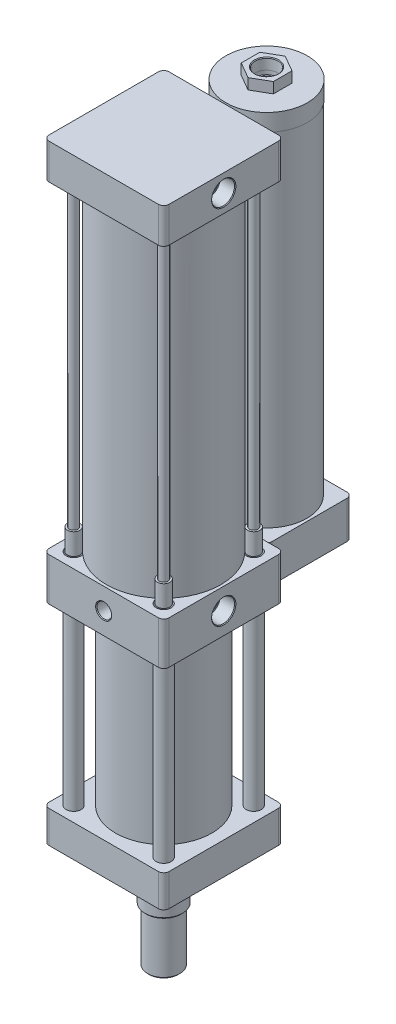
from build123d import *

# Parameters (mm, degrees)
SKETCH_1_R             = 7
EXTRUDE_1_DEPTH        = 30
SKETCH_2_R             = 45
EXTRUDE_2_DEPTH        = 165
SKETCH_3_R             = 7
EXTRUDE_3_DEPTH        = 40
SKETCH_4_R             = 5.75
EXTRUDE_4_DEPTH        = 20
EXTRUDE_4_2_DEPTH      = 20
EXTRUDE_4_3_DEPTH      = 20
EXTRUDE_4_4_DEPTH      = 20
SKETCH_5_R             = 53.5
EXTRUDE_5_DEPTH        = 301
EXTRUDE_6_DEPTH        = 33
SKETCH_7_R             = 4
EXTRUDE_7_DEPTH        = 281
SKETCH_8_R             = 27.5
EXTRUDE_8_DEPTH        = 19
SKETCH_9_R             = 17.5
EXTRUDE_9_DEPTH        = 31
SKETCH_10_R            = 15
EXTRUDE_10_DEPTH       = 50
CHAMFER_1_SIZE         = 1.5
SKETCH_11_R            = 7
EXTRUDE_11_DEPTH       = 195
EXTRUDE_11_2_DEPTH     = 195
EXTRUDE_11_3_DEPTH     = 195
EXTRUDE_11_4_DEPTH     = 195
EXTRUDE_12_DEPTH       = 35
SKETCH_13_R            = 37.5
EXTRUDE_13_DEPTH       = 320
SKETCH_14_R            = 38
EXTRUDE_14_DEPTH       = 16
EXTRUDE_15_DEPTH       = 10
F_1_2_NPT_2_AT_2_COUNT = 2
F_1_2_NPT_2_AT_2_PITCH = 337.5


with BuildPart() as part:
    # Sketch 1 → Extrude 1 (new body)
    with BuildSketch(Plane(origin=(0, 0, 0), x_dir=(1, 0, 0), z_dir=(0, 1, 0))):
        with BuildLine():
            Line((51, 56), (-51, 56))
            ThreePointArc((-51, 56), (-54.535533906, 54.535533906), (-56, 51))
            Line((-56, 51), (-56, -51))
            ThreePointArc((-56, -51), (-54.535533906, -54.535533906), (-51, -56))
            Line((-51, -56), (51, -56))
            ThreePointArc((51, -56), (54.535533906, -54.535533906), (56, -51))
            Line((56, -51), (56, 51))
            ThreePointArc((56, 51), (54.535533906, 54.535533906), (51, 56))
        make_face()
        with Locations(Location((42, -42, 0), (0, 0, 270))):
            Circle(SKETCH_1_R, mode=Mode.SUBTRACT)
        with Locations(Location((-42, -42, 0), (0, 0, 270))):
            Circle(SKETCH_1_R, mode=Mode.SUBTRACT)
        with Locations(Location((-42, 42, 0), (0, 0, 270))):
            Circle(SKETCH_1_R, mode=Mode.SUBTRACT)
        with Locations(Location((42, 42, 0), (0, 0, 270))):
            Circle(SKETCH_1_R, mode=Mode.SUBTRACT)
    extrude(amount=EXTRUDE_1_DEPTH)

    # Sketch 2 → Extrude 2 (add)
    with BuildSketch(Plane(origin=(0, 30, 0), x_dir=(1, 0, 0), z_dir=(0, 1, 0))):
        with Locations(Location((0, 0, 0), (0, 0, 270))):
            Circle(SKETCH_2_R)
    extrude(amount=EXTRUDE_2_DEPTH)

    # Sketch 3 → Extrude 3 (add)
    with BuildSketch(Plane(origin=(0, 195, 0), x_dir=(1, 0, 0), z_dir=(0, 1, 0))):
        with BuildLine():
            Line((56, -51), (56, 51))
            ThreePointArc((56, 51), (54.535533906, 54.535533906), (51, 56))
            Line((51, 56), (-51, 56))
            ThreePointArc((-51, 56), (-54.535533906, 54.535533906), (-56, 51))
            Line((-56, 51), (-56, -51))
            ThreePointArc((-56, -51), (-54.535533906, -54.535533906), (-51, -56))
            Line((-51, -56), (51, -56))
            ThreePointArc((51, -56), (54.535533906, -54.535533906), (56, -51))
        make_face()
        with Locations(Location((-42, -42, 0), (0, 0, 270))):
            Circle(SKETCH_3_R, mode=Mode.SUBTRACT)
        with Locations(Location((-42, 42, 0), (0, 0, 270))):
            Circle(SKETCH_3_R, mode=Mode.SUBTRACT)
        with Locations(Location((42, -42, 0), (0, 0, 270))):
            Circle(SKETCH_3_R, mode=Mode.SUBTRACT)
        with Locations(Location((42, 42, 0), (0, 0, 270))):
            Circle(SKETCH_3_R, mode=Mode.SUBTRACT)
    extrude(amount=EXTRUDE_3_DEPTH)

    # Sketch 5 → Extrude 5 (add)
    with BuildSketch(Plane(origin=(0, 235, 0), x_dir=(1, 0, 0), z_dir=(0, 1, 0))):
        with Locations(Location((0, 0, 0), (0, 0, 131.165734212))):
            Circle(SKETCH_5_R)
    extrude(amount=EXTRUDE_5_DEPTH)

    # Sketch 6 → Extrude 6 (add)
    with BuildSketch(Plane(origin=(0, 536, 0), x_dir=(1, 0, 0), z_dir=(0, 1, 0))):
        with BuildLine():
            Line((56, -51), (56, 51))
            ThreePointArc((56, 51), (54.535533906, 54.535533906), (51, 56))
            Line((51, 56), (-51, 56))
            ThreePointArc((-51, 56), (-54.535533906, 54.535533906), (-56, 51))
            Line((-56, 51), (-56, -51))
            ThreePointArc((-56, -51), (-54.535533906, -54.535533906), (-51, -56))
            Line((-51, -56), (51, -56))
            ThreePointArc((51, -56), (54.535533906, -54.535533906), (56, -51))
        make_face()
    extrude(amount=EXTRUDE_6_DEPTH)



with BuildPart() as body_2:
    # Sketch 4 → Extrude 4 (new body)
    with BuildSketch(Plane(origin=(0, 235, 0), x_dir=(1, 0, 0), z_dir=(0, 1, 0))):
        with Locations(Location((-42, 42, 0), (0, 0, 270))):
            Circle(SKETCH_4_R)
    extrude(amount=EXTRUDE_4_DEPTH)


with BuildPart() as body_3:
    # Sketch 4 → Extrude 4 2 (new body)
    with BuildSketch(Plane(origin=(0, 235, 0), x_dir=(1, 0, 0), z_dir=(0, 1, 0))):
        with Locations(Location((42, 42, 0), (0, 0, 270))):
            Circle(SKETCH_4_R)
    extrude(amount=EXTRUDE_4_2_DEPTH)


with BuildPart() as body_4:
    # Sketch 4 → Extrude 4 3 (new body)
    with BuildSketch(Plane(origin=(0, 235, 0), x_dir=(1, 0, 0), z_dir=(0, 1, 0))):
        with Locations(Location((-42, -42, 0), (0, 0, 270))):
            Circle(SKETCH_4_R)
    extrude(amount=EXTRUDE_4_3_DEPTH)


with BuildPart() as body_5:
    # Sketch 4 → Extrude 4 4 (new body)
    with BuildSketch(Plane(origin=(0, 235, 0), x_dir=(1, 0, 0), z_dir=(0, 1, 0))):
        with Locations(Location((42, -42, 0), (0, 0, 270))):
            Circle(SKETCH_4_R)
    extrude(amount=EXTRUDE_4_4_DEPTH)


with BuildPart() as part_1:
    add(part.part)

    add(body_2.part)  # Extrude 7 merges body 2

    add(body_3.part)  # Extrude 7 merges body 3

    add(body_4.part)  # Extrude 7 merges body 4

    add(body_5.part)  # Extrude 7 merges body 5
    # Sketch 7 → Extrude 7 (add)
    with BuildSketch(Plane(origin=(0, 255, 0), x_dir=(1, 0, 0), z_dir=(0, 1, 0))):
        with Locations(Location((-42, 42, 0), (0, 0, 270))):
            Circle(SKETCH_7_R)
        with Locations(Location((42, 42, 0), (0, 0, 270))):
            Circle(SKETCH_7_R)
        with Locations(Location((42, -42, 0), (0, 0, 270))):
            Circle(SKETCH_7_R)
        with Locations(Location((-42, -42, 0), (0, 0, 270))):
            Circle(SKETCH_7_R)
    extrude(amount=EXTRUDE_7_DEPTH)

    # Sketch 8 → Extrude 8 (add)
    with BuildSketch(Plane.XZ):
        with Locations(Location((0, 0, 0), (0, 0, 90))):
            Circle(SKETCH_8_R)
    extrude(amount=EXTRUDE_8_DEPTH)

    # Sketch 9 → Extrude 9 (add)
    with BuildSketch(Plane.XZ.offset(19)):
        with Locations(Location((0, 0, 0), (0, 0, 270))):
            Circle(SKETCH_9_R)
    extrude(amount=EXTRUDE_9_DEPTH)

    # Sketch 10 → Extrude 10 (add)
    with BuildSketch(Plane.XZ.offset(50)):
        with Locations(Location((0, 0, 0), (0, 0, 270))):
            Circle(SKETCH_10_R)
    extrude(amount=EXTRUDE_10_DEPTH)

    # Chamfer 1
    chamfer_1_edges = [part_1.edges().sort_by_distance(p)[0] for p in [
        (0, -100, 15),
        (0, -50, 17.5),
    ]]
    chamfer(chamfer_1_edges, length=CHAMFER_1_SIZE)

    # Sketch 19 → 1_2 NPT _2 (revolve, cut)
    with BuildSketch(Plane(origin=(56, 552.5, 0), x_dir=(0, 0, -1), z_dir=(0, 1, 0))):
        Polygon((0, 0), (0, 28.004543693), (8.9281, 22.64), (8.9281, 13.57), (10.280670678, 13.57), (10.6679619, 0.635), (11.3029619, 0), align=None)
    f_1_2_npt_2 = revolve(axis=Axis((62.35, 552.5, 0), (-1, 0, 0)), mode=Mode.SUBTRACT)

    # 1_2 NPT _2 at 2: 1_2 NPT _2 ×2
    with Locations(*[(0, -i * F_1_2_NPT_2_AT_2_PITCH, 0) for i in range(1, F_1_2_NPT_2_AT_2_COUNT)]):
        add(f_1_2_npt_2, mode=Mode.SUBTRACT)

    # Sketch 21 → 1_2 NPT _3 (revolve, cut)
    with BuildSketch(Plane(origin=(6.68545356, 15, -56), x_dir=(0, 1, 0), z_dir=(1, 0, 0))):
        Polygon((0, 0), (0, 28.004543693), (8.9281, 22.64), (8.9281, 13.57), (10.280670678, 13.57), (10.6679619, 0.635), (11.3029619, 0), align=None)
    revolve(axis=Axis((6.68545356, 15, -62.35), (0, 0, 1)), mode=Mode.SUBTRACT)

    # Sketch 23 → 1_4 NPT _1 (revolve, cut)
    with BuildSketch(Plane(origin=(-56, 215, 0), x_dir=(0, 0, 1), z_dir=(0, 1, 0))):
        Polygon((0, 0), (0, 20.412347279), (5.5626, 17.07), (5.5626, 10.02), (6.576987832, 10.02), (6.8579873, 0.635), (7.4929873, 0), align=None)
    revolve(axis=Axis((-62.35, 215, 0), (1, 0, 0)), mode=Mode.SUBTRACT)

    # Sketch 25 → 1_4 NPT _2 (revolve, cut)
    with BuildSketch(Plane(origin=(0, 215, 56), x_dir=(0, -1, 0), z_dir=(1, 0, 0))):
        Polygon((0, 0), (0, 20.412347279), (5.5626, 17.07), (5.5626, 10.02), (6.576987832, 10.02), (6.8579873, 0.635), (7.4929873, 0), align=None)
    revolve(axis=Axis((0, 215, 62.35), (0, 0, -1)), mode=Mode.SUBTRACT)


with BuildPart() as body_2_2:
    # Sketch 11 → Extrude 11 (new body)
    with BuildSketch(Plane.XZ):
        with Locations(Location((42, 42, 0), (0, 0, 270))):
            Circle(SKETCH_11_R)
    extrude(amount=-EXTRUDE_11_DEPTH)


with BuildPart() as body_3_2:
    # Sketch 11 → Extrude 11 2 (new body)
    with BuildSketch(Plane.XZ):
        with Locations(Location((-42, 42, 0), (0, 0, 270))):
            Circle(SKETCH_11_R)
    extrude(amount=-EXTRUDE_11_2_DEPTH)


with BuildPart() as body_4_2:
    # Sketch 11 → Extrude 11 3 (new body)
    with BuildSketch(Plane.XZ):
        with Locations(Location((-42, -42, 0), (0, 0, 270))):
            Circle(SKETCH_11_R)
    extrude(amount=-EXTRUDE_11_3_DEPTH)


with BuildPart() as body_5_2:
    # Sketch 11 → Extrude 11 4 (new body)
    with BuildSketch(Plane.XZ):
        with Locations(Location((42, -42, 0), (0, 0, 270))):
            Circle(SKETCH_11_R)
    extrude(amount=-EXTRUDE_11_4_DEPTH)


with BuildPart() as body_6:
    # Sketch 12 → Extrude 12 (new body)
    with BuildSketch(Plane(origin=(0, 197.5, 0), x_dir=(-1, 0, 0), z_dir=(0, -1, 0))):
        with BuildLine():
            Line((35, 136), (-35, 136))
            ThreePointArc((-35, 136), (-38.535533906, 134.535533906), (-40, 131))
            Line((-40, 131), (-40, 61))
            ThreePointArc((-40, 61), (-38.535533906, 57.464466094), (-35, 56))
            Line((-35, 56), (35, 56))
            ThreePointArc((35, 56), (38.535533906, 57.464466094), (40, 61))
            Line((40, 61), (40, 131))
            ThreePointArc((40, 131), (38.535533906, 134.535533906), (35, 136))
        make_face()
    extrude(amount=-EXTRUDE_12_DEPTH)


with BuildPart() as body_7:
    # Sketch 13 → Extrude 13 (new body)
    with BuildSketch(Plane(origin=(0, 232.5, 0), x_dir=(1, 0, 0), z_dir=(0, 1, 0))):
        with Locations(Location((0, 96, 0), (0, 0, 270))):
            Circle(SKETCH_13_R)
    extrude(amount=EXTRUDE_13_DEPTH)


with BuildPart() as body_8:
    # Sketch 14 → Extrude 14 (new body)
    with BuildSketch(Plane(origin=(0, 552.5, 0), x_dir=(1, 0, 0), z_dir=(0, 1, 0))):
        with Locations(Location((0, 96, 0), (0, 0, 270))):
            Circle(SKETCH_14_R)
    extrude(amount=EXTRUDE_14_DEPTH)


with BuildPart() as body_9:
    # Sketch 15 → Extrude 15 (new body)
    with BuildSketch(Plane(origin=(0, 568.5, 0), x_dir=(1, 0, 0), z_dir=(0, 1, 0))):
        Polygon((0, 113.320508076), (-15, 104.660254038), (-15, 87.339745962), (0, 78.679491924), (15, 87.339745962), (15, 104.660254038), align=None)
    extrude(amount=EXTRUDE_15_DEPTH)


with BuildPart() as f_1_2_npt_1_tool:
    # Sketch 17 → 1_2 NPT _1 (revolve)
    with BuildSketch(Plane(origin=(0, 578.5, -96), x_dir=(0, 0, 1), z_dir=(1, 0, 0))):
        Polygon((0, 0), (0, 28.004543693), (8.9281, 22.64), (8.9281, 13.57), (10.280670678, 13.57), (10.6679619, 0.635), (11.3029619, 0), align=None)
    revolve(axis=Axis((0, 584.85, -96), (0, -1, 0)))


with BuildPart() as body_7_1:
    add(body_7.part)

    # 1_2 NPT _1: cut by f_1_2_npt_1_tool
    add(f_1_2_npt_1_tool.part, mode=Mode.SUBTRACT)


with BuildPart() as body_8_1:
    add(body_8.part)

    # 1_2 NPT _1: cut by f_1_2_npt_1_tool
    add(f_1_2_npt_1_tool.part, mode=Mode.SUBTRACT)


with BuildPart() as body_9_1:
    add(body_9.part)

    # 1_2 NPT _1: cut by f_1_2_npt_1_tool
    add(f_1_2_npt_1_tool.part, mode=Mode.SUBTRACT)


solid = Compound([part_1.part, body_2_2.part, body_3_2.part, body_4_2.part, body_5_2.part, body_6.part, body_7_1.part, body_8_1.part, body_9_1.part])
